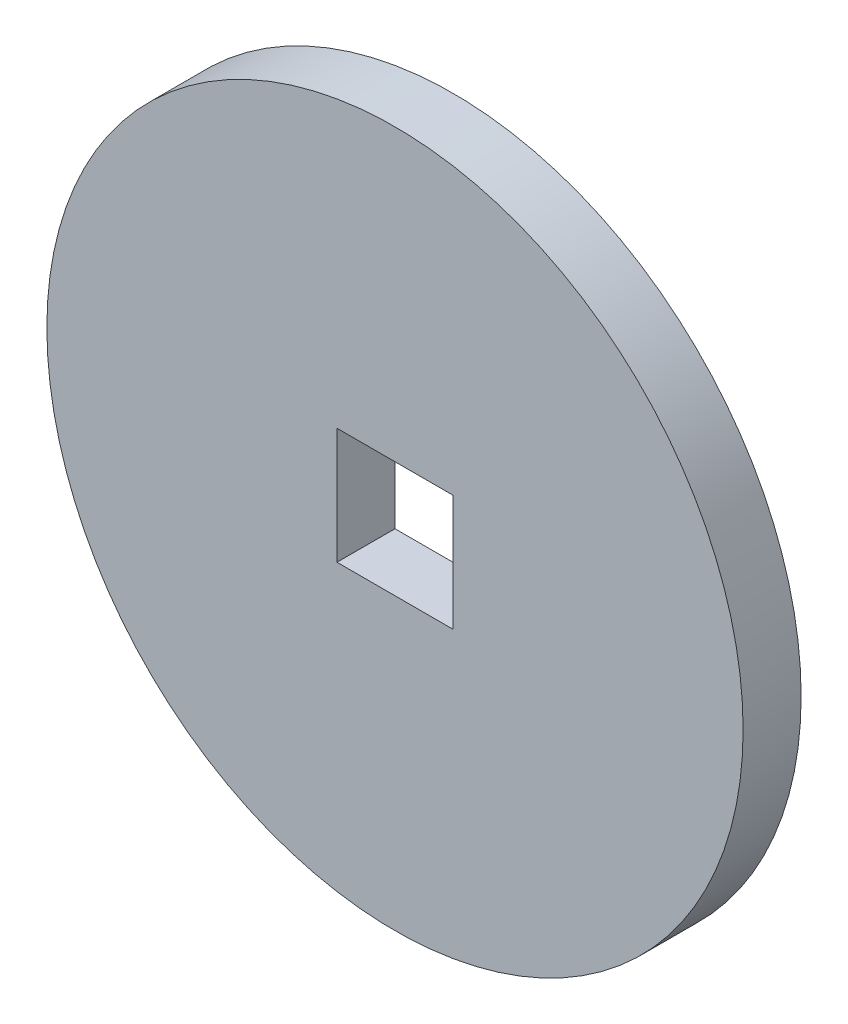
from build123d import *

# Parameters (mm, degrees)
SKETCH1_R           = 19.05
SKETCH1_W           = 6.35
SKETCH1_H           = 6.35
BOSS_EXTRUDE1_DEPTH = 3.175


with BuildPart() as part:
    # Sketch1 → Boss-Extrude1 (new body)
    with BuildSketch(Plane.XY):
        with Locations((-39.706070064, 27.763315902)):
            Circle(SKETCH1_R)
        with Locations((-39.706070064, 27.763315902)):
            Rectangle(SKETCH1_W, SKETCH1_H, mode=Mode.SUBTRACT)
    extrude(amount=BOSS_EXTRUDE1_DEPTH)


solid = part.part
